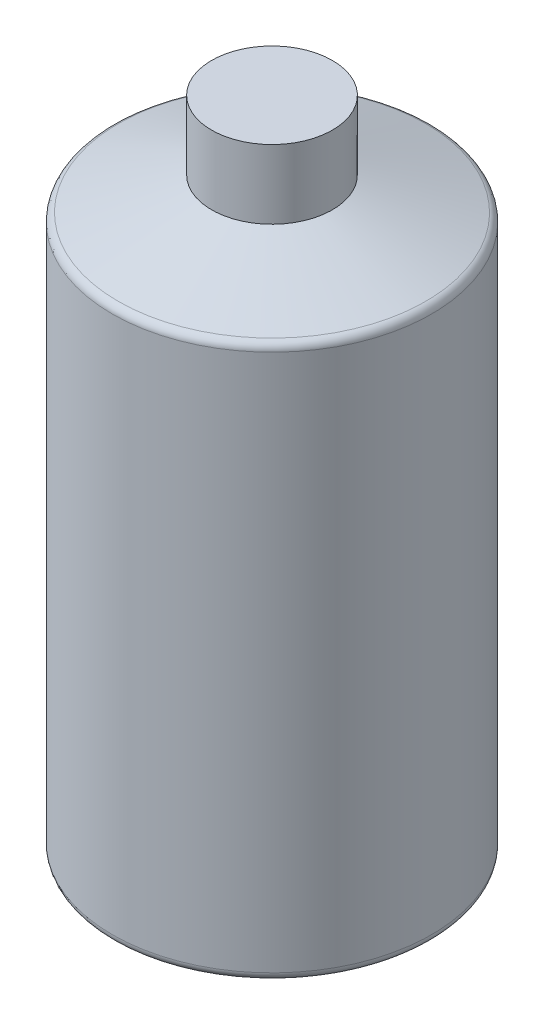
from build123d import *

# Parameters (mm, degrees)
FILLET1_R = 3.175


with BuildPart() as part:
    # Sketch1 → Revolve1 (revolve)
    with BuildSketch(Plane.XY, mode=Mode.PRIVATE) as revolve1_sk:
        Polygon((0, 241.3), (-22.225, 241.3), (-22.225, 215.9), (-58.7375, 203.2), (-58.7375, 0), (0, 0), align=None)
    revolve(revolve1_sk.sketch.rotate(Axis((0, 0, 0), (0, 1, 0)), 270), axis=Axis((0, 0, 0), (0, 1, 0)))

    # Fillet1
    fillet1_edges = [part.edges().sort_by_distance(p)[0] for p in [
        (0, 0, 58.7375),
        (0, 203.2, 58.7375),
    ]]
    fillet(fillet1_edges, radius=FILLET1_R)


solid = part.part
